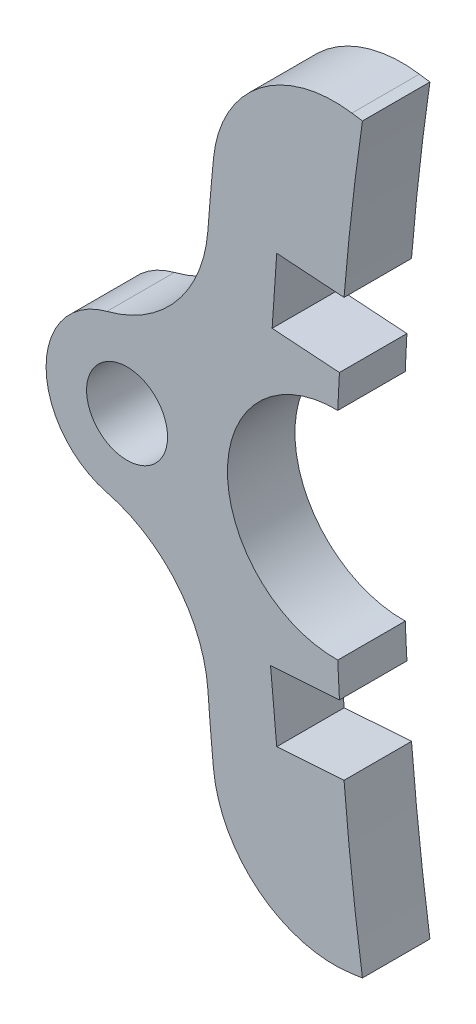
from build123d import *

# Parameters (mm, degrees)
AUFSATZ_LINEAR_AUSTRAGEN1_DEPTH      = 2.5
AUFSATZ_LINEAR_AUSTRAGEN1_DEPTH_BACK = 2.5
SKIZZE2_R                            = 3


with BuildPart() as part:
    # Skizze2 → Aufsatz-Linear austragen1 (new, two sides: drawn at the far end of the back side and taken through both)
    with BuildSketch(Plane.XY.offset(-AUFSATZ_LINEAR_AUSTRAGEN1_DEPTH_BACK)):
        with BuildLine():
            Line((-197.197352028, 26.212365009), (-196.416978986, 26.09864222))
            ThreePointArc((-196.416978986, 26.09864222), (-197.193532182, 20.105973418), (-197.779827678, 14.091709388))
            Line((-197.779827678, 14.091709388), (-202.768196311, 14.43255889))
            Line((-202.768196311, 14.43255889), (-203.109045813, 9.444190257))
            Line((-203.109045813, 9.444190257), (-198.12067718, 9.103340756))
            ThreePointArc((-198.12067718, 9.103340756), (-198.185444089, 7.85498617), (-198.242026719, 6.60623386))
            ThreePointArc((-198.242026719, 6.60623386), (-206.41958023, -1.40135778), (-198.242026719, -9.408949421))
            ThreePointArc((-198.242026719, -9.408949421), (-198.185444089, -10.65770173), (-198.12067718, -11.906056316))
            Line((-198.12067718, -11.906056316), (-203.226724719, -12.254946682))
            Line((-203.226724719, -12.254946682), (-202.768196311, -17.235274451))
            Line((-202.768196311, -17.235274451), (-197.779827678, -16.894424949))
            ThreePointArc((-197.779827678, -16.894424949), (-197.193532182, -22.908688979), (-196.416978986, -28.90135778))
            Line((-196.416978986, -28.90135778), (-197.197352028, -29.015080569))
            ThreePointArc((-197.197352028, -29.015080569), (-204.042860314, -27.196003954), (-207.452243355, -20.987450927))
            ThreePointArc((-207.452243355, -20.987450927), (-207.673995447, -18.576323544), (-207.866643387, -16.162696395))
            ThreePointArc((-207.866643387, -16.162696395), (-210.168505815, -10.482977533), (-215.351445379, -7.212669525))
            ThreePointArc((-215.351445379, -7.212669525), (-219.858577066, -1.40135778), (-215.351445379, 4.409953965))
            ThreePointArc((-215.351445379, 4.409953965), (-210.168505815, 7.680261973), (-207.866643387, 13.359980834))
            ThreePointArc((-207.866643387, 13.359980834), (-207.673995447, 15.773607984), (-207.452243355, 18.184735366))
            ThreePointArc((-207.452243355, 18.184735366), (-204.042860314, 24.393288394), (-197.197352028, 26.212365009))
        make_face()
        with Locations((-213.858577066, -1.40135778)):
            Circle(SKIZZE2_R, mode=Mode.SUBTRACT)
    extrude(amount=AUFSATZ_LINEAR_AUSTRAGEN1_DEPTH + AUFSATZ_LINEAR_AUSTRAGEN1_DEPTH_BACK)


solid = part.part
